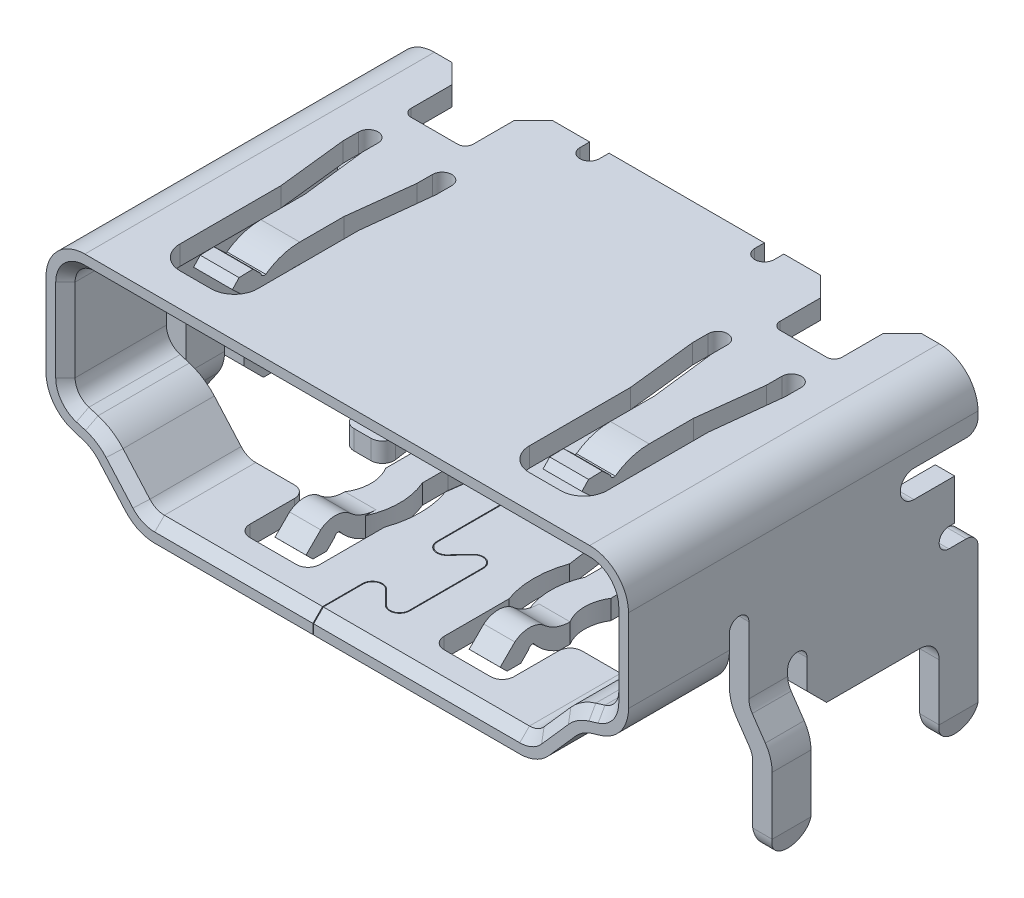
from build123d import *

# Parameters (mm, degrees)
RESSALTO_EXTRUS_O1_DEPTH      = 8.3
RESSALTO_EXTRUS_O1_DEPTH_BACK = 0.7
CHANFRO1_SIZE                 = 0.25
CORTE_EXTRUS_O1_DEPTH         = 3
RESSALTO_EXTRUS_O3_DEPTH      = 0.5
ESBO_O9_W                     = 0.5
ESBO_O9_H                     = 1
FILETE1_R                     = 0.499
FILETE1_OF_ESPELHAR3_R        = 0.499
CORTE_EXTRUS_O2_DEPTH         = 1
CORTE_EXTRUS_O3_DEPTH         = 1
CORTE_EXTRUS_O4_DEPTH         = 1
RESSALTO_EXTRUS_O4_DEPTH      = 0.8
RESSALTO_EXTRUS_O5_DEPTH      = 1
CORTE_EXTRUS_O5_DEPTH         = 11


with BuildPart() as part:
    # Esbo_o2 → Ressalto-extrus_o1 (new, two sides: drawn at the far end of the back side and taken through both)
    with BuildSketch(Plane.XY.offset(-RESSALTO_EXTRUS_O1_DEPTH_BACK)):
        with BuildLine():
            Line((13.5, 2.775), (26.5, 2.775))
            ThreePointArc((26.5, 2.775), (27.207106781, 2.482106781), (27.5, 1.775))
            Line((27.5, 1.775), (27.5, -0.36))
            ThreePointArc((27.5, -0.36), (27.303276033, -0.95560693), (26.79050477, -1.316873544))
            Line((26.79050477, -1.316873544), (26.553545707, -1.388813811))
            ThreePointArc((26.553545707, -1.388813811), (26.328421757, -1.492872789), (26.140247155, -1.654425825))
            Line((26.140247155, -1.654425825), (25.449725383, -2.436749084))
            ThreePointArc((25.449725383, -2.436749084), (25.111248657, -2.686523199), (24.7, -2.775))
            Line((24.7, -2.775), (15.3, -2.775))
            ThreePointArc((15.3, -2.775), (14.888751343, -2.686523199), (14.550274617, -2.436749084))
            Line((14.550274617, -2.436749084), (13.859752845, -1.654425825))
            ThreePointArc((13.859752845, -1.654425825), (13.671578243, -1.492872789), (13.446454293, -1.388813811))
            Line((13.446454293, -1.388813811), (13.20949523, -1.316873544))
            ThreePointArc((13.20949523, -1.316873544), (12.696723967, -0.95560693), (12.5, -0.36))
            Line((12.5, -0.36), (12.5, 1.775))
            ThreePointArc((12.5, 1.775), (12.792893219, 2.482106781), (13.5, 2.775))
        make_face()
        with BuildLine():
            Line((13.5, 2.275), (26.5, 2.275))
            ThreePointArc((26.5, 2.275), (26.853553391, 2.128553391), (27, 1.775))
            Line((27, 1.775), (27, -0.36))
            ThreePointArc((27, -0.36), (26.901638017, -0.657803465), (26.645252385, -0.838436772))
            Line((26.645252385, -0.838436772), (26.408293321, -0.910377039))
            ThreePointArc((26.408293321, -0.910377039), (26.05810051, -1.072246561), (25.765384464, -1.323551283))
            Line((25.765384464, -1.323551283), (25.074862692, -2.105874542))
            ThreePointArc((25.074862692, -2.105874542), (24.905624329, -2.230761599), (24.7, -2.275))
            Line((24.7, -2.275), (15.3, -2.275))
            ThreePointArc((15.3, -2.275), (15.094375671, -2.230761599), (14.925137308, -2.105874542))
            Line((14.925137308, -2.105874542), (14.234615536, -1.323551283))
            ThreePointArc((14.234615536, -1.323551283), (13.94189949, -1.072246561), (13.591706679, -0.910377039))
            Line((13.591706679, -0.910377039), (13.354747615, -0.838436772))
            ThreePointArc((13.354747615, -0.838436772), (13.098361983, -0.657803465), (13, -0.36))
            Line((13, -0.36), (13, 1.775))
            ThreePointArc((13, 1.775), (13.146446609, 2.128553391), (13.5, 2.275))
        make_face(mode=Mode.SUBTRACT)
    extrude(amount=RESSALTO_EXTRUS_O1_DEPTH + RESSALTO_EXTRUS_O1_DEPTH_BACK)

    # Chanfro1
    chanfro1_edges = [part.edges().sort_by_distance(p)[0] for p in [
        (13.94189949, -1.072246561, 8.3),
        (14.579876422, -1.714712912, 8.3),
        (15.094375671, -2.230761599, 8.3),
        (20, -2.275, 8.3),
        (24.905624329, -2.230761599, 8.3),
        (25.420123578, -1.714712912, 8.3),
        (26.05810051, -1.072246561, 8.3),
        (26.526772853, -0.874406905, 8.3),
        (26.901638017, -0.657803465, 8.3),
        (27, 0.7075, 8.3),
        (26.853553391, 2.128553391, 8.3),
        (20, 2.275, 8.3),
        (13.146446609, 2.128553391, 8.3),
        (13, 0.7075, 8.3),
        (13.098361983, -0.657803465, 8.3),
        (13.473227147, -0.874406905, 8.3),
    ]]
    chamfer(chanfro1_edges, length=CHANFRO1_SIZE)

    # Esbo_o3 → Corte-extrus_o1 (cut)
    with BuildSketch(Plane(origin=(27.5, 0, 0), x_dir=(0, 0, -1), z_dir=(1, 0, 0))):
        with BuildLine():
            Line((-5.7, 0.025), (-5.7, -4.040151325))
            Line((-5.7, -4.040151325), (-5.2, -4.040151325))
            Line((-5.2, -4.040151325), (1.122499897, -4.040151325))
            Line((1.122499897, -4.040151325), (1.122499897, -0.225))
            Line((1.122499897, -0.225), (1.122499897, 1.775))
            Line((1.122499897, 1.775), (0.7, 1.775))
            Line((0.7, 1.775), (0.7, 1.625))
            ThreePointArc((0.7, 1.625), (0.612132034, 1.412867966), (0.4, 1.325))
            Line((0.4, 1.325), (-0.95, 1.325))
            ThreePointArc((-0.95, 1.325), (-1.3, 0.975), (-0.95, 0.625))
            Line((-0.95, 0.625), (0.1, 0.625))
            Line((0.1, 0.625), (0.1, -0.225))
            Line((0.1, -0.225), (-5.2, -0.225))
            Line((-5.2, -0.225), (-5.2, 0.025))
            ThreePointArc((-5.2, 0.025), (-5.45, 0.275), (-5.7, 0.025))
        make_face()
    corte_extrus_o1 = extrude(amount=-CORTE_EXTRUS_O1_DEPTH, mode=Mode.SUBTRACT)

    # Espelhar1: Corte-extrus_o1 across plane
    add(corte_extrus_o1.mirror(Plane.ZY.offset(-20)), mode=Mode.SUBTRACT)

    # Esbo_o6 → Ressalto-extrus_o3 (add)
    with BuildSketch(Plane(origin=(27.5, 0, 0), x_dir=(0, 0, -1), z_dir=(1, 0, 0))):
        with BuildLine():
            Line((0.1, -0.225), (0.1, -0.425))
            Line((0.1, -0.425), (-0.05, -0.425))
            ThreePointArc((-0.05, -0.425), (-0.3, -0.675), (-0.05, -0.925))
            Line((-0.05, -0.925), (0.4, -0.925))
            ThreePointArc((0.4, -0.925), (0.612132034, -1.012867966), (0.7, -1.225))
            Line((0.7, -1.225), (0.7, -4.725))
            ThreePointArc((0.7, -4.725), (0.2, -5.225), (-0.3, -4.725))
            Line((-0.3, -4.725), (-0.3, -3.275))
            ThreePointArc((-0.3, -3.275), (-0.446446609, -2.921446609), (-0.8, -2.775))
            Line((-0.8, -2.775), (-3.2, -2.775))
            Line((-3.2, -2.775), (-3.7, -2.275))
            Line((-3.7, -2.275), (-3.7, -1.525))
            ThreePointArc((-3.7, -1.525), (-3.95, -1.275), (-4.2, -1.525))
            Line((-4.2, -1.525), (-4.2, -1.695))
            Line((-4.2, -1.695), (-5.2, -1.695))
            Line((-5.2, -1.695), (-5.2, -1.05080475))
            Line((-5.2, -1.05080475), (-5.2, -0.225))
            Line((-5.2, -0.225), (0.1, -0.225))
        make_face()
    ressalto_extrus_o3 = extrude(amount=-RESSALTO_EXTRUS_O3_DEPTH)

    # Espelhar2: Ressalto-extrus_o3 across plane
    add(ressalto_extrus_o3.mirror(Plane.ZY.offset(-20)))

    # Varredura1: sweep along a path in Esbo_o8
    with BuildLine(Plane.XY.offset(5.2)) as varredura1_path:
        Line((27.849, -5.025), (27.849, -3.035))
        ThreePointArc((27.849, -3.035), (27.815578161, -2.813089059), (27.718, -2.611))
        Line((27.718, -2.611), (27.381, -2.119))
        ThreePointArc((27.381, -2.119), (27.283421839, -1.916910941), (27.25, -1.695))
    # Esbo_o9 → Varredura1 (sweep)
    with BuildSketch(Plane.XZ.offset(1.695)):
        with Locations((27.25, 4.7)):
            Rectangle(ESBO_O9_W, ESBO_O9_H)
    varredura1 = sweep(path=varredura1_path.line, transition=Transition.RIGHT)

    # Filete1
    filete1_edges = [part.edges().sort_by_distance(p)[0] for p in [
        (27.849, -5.025, 4.2),
        (27.849, -5.025, 5.2),
    ]]
    fillet(filete1_edges, radius=FILETE1_R)

    # Espelhar3: Varredura1 across plane
    add(varredura1.mirror(Plane.ZY.offset(-20)))

    # Filete1 of Espelhar3
    filete1_of_espelhar3_edges = [part.edges().sort_by_distance(p)[0] for p in [
        (12.151, -5.025, 4.2),
        (12.151, -5.025, 5.2),
    ]]
    fillet(filete1_of_espelhar3_edges, radius=FILETE1_OF_ESPELHAR3_R)

    # Esbo_o10 → Corte-extrus_o2 (cut)
    with BuildSketch(Plane(origin=(0, 2.775, 0), x_dir=(1, 0, 0), z_dir=(0, 1, 0))):
        with BuildLine():
            Line((26.05, 0.7), (25.55, 0.2))
            Line((25.55, 0.2), (25.55, -0.85))
            ThreePointArc((25.55, -0.85), (25.491421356, -0.991421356), (25.35, -1.05))
            Line((25.35, -1.05), (24.15, -1.05))
            ThreePointArc((24.15, -1.05), (24.008578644, -0.991421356), (23.95, -0.85))
            Line((23.95, -0.85), (23.95, 0.2))
            Line((23.95, 0.2), (23.45, 0.7))
            Line((23.45, 0.7), (22.5, 0.7))
            Line((22.5, 0.7), (22.5, 0.45))
            ThreePointArc((22.5, 0.45), (22.25, 0.2), (22, 0.45))
            Line((22, 0.45), (22, 1.825806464))
            Line((22, 1.825806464), (26.05, 1.825806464))
            Line((26.05, 1.825806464), (26.05, 0.7))
        make_face()
        with BuildLine():
            Line((24.1, -7.45), (24.9, -7.45))
            ThreePointArc((24.9, -7.45), (25.324264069, -7.274264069), (25.5, -6.85))
            Line((25.5, -6.85), (25.5, -4.25))
            Line((25.5, -4.25), (25.7, -2.45))
            Line((25.7, -2.45), (25.7, -2.05))
            ThreePointArc((25.7, -2.05), (25.45, -1.8), (25.2, -2.05))
            Line((25.2, -2.05), (25.2, -2.45))
            Line((25.2, -2.45), (25, -4.13))
            Line((25, -4.13), (25, -4.25))
            Line((25, -4.25), (25, -5.2673))
            Line((25, -5.2673), (24, -5.2673))
            Line((24, -5.2673), (24, -4.25))
            Line((24, -4.25), (24, -4.13))
            Line((24, -4.13), (23.8, -2.45))
            Line((23.8, -2.45), (23.8, -2.05))
            ThreePointArc((23.8, -2.05), (23.55, -1.8), (23.3, -2.05))
            Line((23.3, -2.05), (23.3, -2.45))
            Line((23.3, -2.45), (23.5, -4.25))
            Line((23.5, -4.25), (23.5, -6.85))
            ThreePointArc((23.5, -6.85), (23.675735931, -7.274264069), (24.1, -7.45))
        make_face()
    corte_extrus_o2 = extrude(amount=-CORTE_EXTRUS_O2_DEPTH, mode=Mode.SUBTRACT)

    # Espelhar4: Corte-extrus_o2 across plane
    add(corte_extrus_o2.mirror(Plane.ZY.offset(-20)), mode=Mode.SUBTRACT)

    # Esbo_o11 → Corte-extrus_o3 (cut)
    with BuildSketch(Plane.XZ.offset(2.775)):
        with BuildLine():
            Line((15.5, 5.7), (16.3, 5.7))
            ThreePointArc((16.3, 5.7), (16.512132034, 5.787867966), (16.6, 6))
            Line((16.6, 6), (16.6, 7.15))
            ThreePointArc((16.6, 7.15), (16.687867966, 7.362132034), (16.9, 7.45))
            Line((16.9, 7.45), (18.1, 7.45))
            ThreePointArc((18.1, 7.45), (18.312132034, 7.362132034), (18.4, 7.15))
            Line((18.4, 7.15), (18.4, 5.482))
            ThreePointArc((18.4, 5.482), (18.537021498, 4.7), (18.4, 3.918))
            Line((18.4, 3.918), (18.6, 2.45))
            Line((18.6, 2.45), (18.6, 1.95))
            ThreePointArc((18.6, 1.95), (18.35, 1.7), (18.1, 1.95))
            Line((18.1, 1.95), (17.9, 3.35))
            Line((17.9, 3.35), (17.9, 4.01))
            ThreePointArc((17.9, 4.01), (18.055740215, 4.7424), (17.9, 5.4748))
            Line((17.9, 5.4748), (17.1, 5.4748))
            Line((17.1, 5.4748), (17.1, 5.2048))
            ThreePointArc((17.1, 5.2048), (17.249484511, 4.67885), (17.1, 4.1529))
            Line((17.1, 4.1529), (17.1, 3.3272))
            Line((17.1, 3.3272), (16.9105, 1.9257))
            ThreePointArc((16.9105, 1.9257), (16.6605, 1.6757), (16.4105, 1.9257))
            Line((16.4105, 1.9257), (16.4105, 2.4257))
            Line((16.4105, 2.4257), (16.5376, 3.3341))
            ThreePointArc((16.5376, 3.3341), (16.466861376, 3.572574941), (16.2405, 3.6757))
            Line((16.2405, 3.6757), (15.8106, 3.6757))
            ThreePointArc((15.8106, 3.6757), (15.598467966, 3.587832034), (15.5106, 3.3757))
            Line((15.5106, 3.3757), (15.5106, 1.3757))
            Line((15.5106, 1.3757), (16.0106, 0.8757))
            Line((16.0106, 0.8757), (17.7106, 0.8757))
            ThreePointArc((17.7106, 0.8757), (17.922732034, 0.787832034), (18.0106, 0.5757))
            Line((18.0106, 0.5757), (18.0106, 0.3757))
            ThreePointArc((18.0106, 0.3757), (18.098467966, 0.163567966), (18.3106, 0.0757))
            Line((18.3106, 0.0757), (20, 0.0757))
            Line((20, 0.0757), (20, -1.100530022))
            Line((20, -1.100530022), (14.919265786, -1.100530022))
            Line((14.919265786, -1.100530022), (14.919265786, 5.2048))
            Line((14.919265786, 5.2048), (15.5, 5.7))
        make_face()
    corte_extrus_o3 = extrude(amount=-CORTE_EXTRUS_O3_DEPTH, mode=Mode.SUBTRACT)

    # Espelhar5: Corte-extrus_o3 across plane
    add(corte_extrus_o3.mirror(Plane.ZY.offset(-20)), mode=Mode.SUBTRACT)

    # Esbo_o12 → Corte-extrus_o4 (cut)
    with BuildSketch(Plane.XZ.offset(2.775)):
        with BuildLine():
            Line((19.4106, -0.117707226), (19.4106, 1.3257))
            ThreePointArc((19.4106, 1.3257), (19.55986004, 1.547848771), (19.82196, 1.493698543))
            Line((19.82196, 1.493698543), (20.164857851, 1.143800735))
            ThreePointArc((20.164857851, 1.143800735), (20.448800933, 1.085135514), (20.6105, 1.325798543))
            Line((20.6105, 1.325798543), (20.6105, 3.2258))
            ThreePointArc((20.6105, 3.2258), (20.448803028, 3.46646363), (20.16486, 3.407801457))
            Line((20.16486, 3.407801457), (19.821957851, 3.057899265))
            ThreePointArc((19.821957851, 3.057899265), (19.559857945, 3.003752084), (19.4106, 3.225901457))
            Line((19.4106, 3.225901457), (19.4106, 5.1259))
            ThreePointArc((19.4106, 5.1259), (19.559797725, 5.348023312), (19.821865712, 5.293994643))
            Line((19.821865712, 5.293994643), (20.146784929, 4.944096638))
            ThreePointArc((20.146784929, 4.944096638), (20.430759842, 4.885310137), (20.59252107, 5.125998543))
            Line((20.59252107, 5.125998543), (20.59252107, 7.026))
            ThreePointArc((20.59252107, 7.026), (20.430824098, 7.26666363), (20.14688107, 7.208001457))
            Line((20.14688107, 7.208001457), (19.803978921, 6.858099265))
            ThreePointArc((19.803978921, 6.858099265), (19.541879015, 6.803952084), (19.39262107, 7.026101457))
            Line((19.39262107, 7.026101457), (19.39262107, 9.06575703))
            ThreePointArc((19.39262107, 9.06575703), (19.38262107, 9.07575703), (19.37262107, 9.06575703))
            Line((19.37262107, 9.06575703), (19.37262107, 7.026098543))
            ThreePointArc((19.37262107, 7.026098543), (19.534320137, 6.785435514), (19.818263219, 6.844100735))
            Line((19.818263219, 6.844100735), (20.16116107, 7.193998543))
            ThreePointArc((20.16116107, 7.193998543), (20.42326103, 7.248148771), (20.57252107, 7.026))
            Line((20.57252107, 7.026), (20.57252107, 5.126001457))
            ThreePointArc((20.57252107, 5.126001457), (20.423324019, 4.903876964), (20.161255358, 4.957905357))
            Line((20.161255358, 4.957905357), (19.836336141, 5.307803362))
            ThreePointArc((19.836336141, 5.307803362), (19.552360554, 5.366589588), (19.3906, 5.1259))
            Line((19.3906, 5.1259), (19.3906, 3.225898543))
            ThreePointArc((19.3906, 3.225898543), (19.552299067, 2.985235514), (19.836242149, 3.043900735))
            Line((19.836242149, 3.043900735), (20.17914, 3.393798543))
            ThreePointArc((20.17914, 3.393798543), (20.44123996, 3.447948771), (20.5905, 3.2258))
            Line((20.5905, 3.2258), (20.5905, 1.325801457))
            ThreePointArc((20.5905, 1.325801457), (20.441242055, 1.103652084), (20.179142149, 1.157799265))
            Line((20.179142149, 1.157799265), (19.83624, 1.507701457))
            ThreePointArc((19.83624, 1.507701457), (19.552296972, 1.56636363), (19.3906, 1.3257))
            Line((19.3906, 1.3257), (19.3906, -0.117707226))
            ThreePointArc((19.3906, -0.117707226), (19.4006, -0.127707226), (19.4106, -0.117707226))
        make_face()
    extrude(amount=-CORTE_EXTRUS_O4_DEPTH, mode=Mode.SUBTRACT)

    # Esbo_o14 → Ressalto-extrus_o4 (add)
    with BuildSketch(Plane(origin=(22.9, 0, 0), x_dir=(0, 0, -1), z_dir=(1, 0, 0))):
        with BuildLine():
            Line((-5.2048, -2.275), (-5.2048, -2.775))
            Line((-5.2048, -2.775), (-5.4748, -2.775))
            ThreePointArc((-5.4748, -2.775), (-5.841679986, -2.580565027), (-6.1412, -2.293))
            ThreePointArc((-6.1412, -2.293), (-6.224464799, -2.298955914), (-6.2742, -2.366))
            Line((-6.2742, -2.366), (-6.4736, -2.5647))
            Line((-6.4736, -2.5647), (-6.8272, -2.5647))
            Line((-6.8272, -2.5647), (-7.0036, -2.3876))
            Line((-7.0036, -2.3876), (-6.627, -2.0125))
            ThreePointArc((-6.627, -2.0125), (-6.219665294, -1.882151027), (-5.829, -2.0562))
            ThreePointArc((-5.829, -2.0562), (-5.535514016, -2.218702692), (-5.2048, -2.275))
        make_face()
    ressalto_extrus_o4 = extrude(amount=-RESSALTO_EXTRUS_O4_DEPTH)

    # Esbo_o15 → Ressalto-extrus_o5 (add)
    with BuildSketch(Plane(origin=(25, 0, 0), x_dir=(0, 0, -1), z_dir=(1, 0, 0))):
        with BuildLine():
            Line((-5.2673, 2.275), (-5.2673, 2.775))
            ThreePointArc((-5.2673, 2.775), (-5.726561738, 2.702927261), (-6.1417, 2.4937))
            ThreePointArc((-6.1417, 2.4937), (-6.224873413, 2.506754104), (-6.2686, 2.5787))
            Line((-6.2686, 2.5787), (-6.475, 2.7735))
            Line((-6.475, 2.7735), (-6.8284, 2.7633))
            Line((-6.8284, 2.7633), (-7, 2.5815))
            Line((-7, 2.5815), (-6.6118, 2.2151))
            ThreePointArc((-6.6118, 2.2151), (-6.240173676, 2.052824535), (-5.8502, 2.164))
            ThreePointArc((-5.8502, 2.164), (-5.56717269, 2.263730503), (-5.2673, 2.275))
        make_face()
    ressalto_extrus_o5 = extrude(amount=-RESSALTO_EXTRUS_O5_DEPTH)

    # Espelhar6: Ressalto-extrus_o4, Ressalto-extrus_o5 across plane
    add(ressalto_extrus_o4.mirror(Plane.ZY.offset(-20)))
    add(ressalto_extrus_o5.mirror(Plane.ZY.offset(-20)))

    # Esbo_o16 → Corte-extrus_o5 (cut)
    with BuildSketch(Plane.XY.offset(5.2)):
        Polygon((28.099, -4.526), (27.999, -5.025), (27.699, -5.025), (27.599, -4.526), (27.555323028, -4.526), (27.5, -4.725), (27.4, -5.225), (27.1, -5.225), (27, -4.725), (26.815237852, -4.725), (26.815237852, -5.379816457), (28.2402866, -5.379816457), (28.2402866, -4.526), align=None)
    corte_extrus_o5 = extrude(amount=-CORTE_EXTRUS_O5_DEPTH, mode=Mode.SUBTRACT)

    # Espelhar7: Corte-extrus_o5 across plane
    add(corte_extrus_o5.mirror(Plane.ZY.offset(-20)), mode=Mode.SUBTRACT)


solid = part.part
